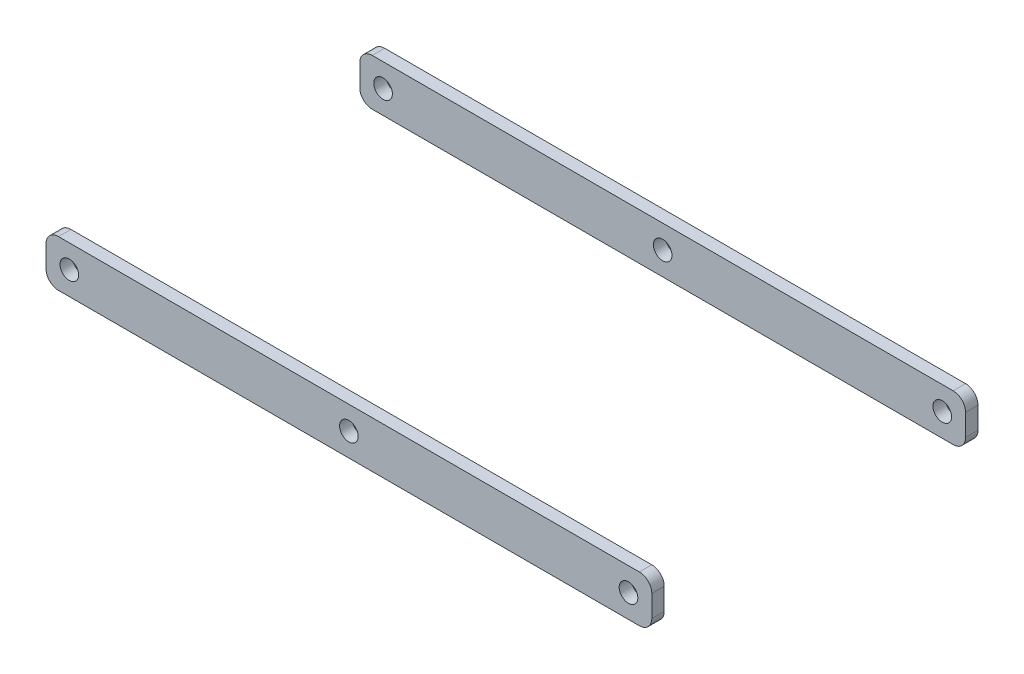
ISO-10303-21;
HEADER;
FILE_DESCRIPTION(('STEP AP214'),'2;1');
FILE_NAME('part.step','',(''),(''),'','','');
FILE_SCHEMA(('AUTOMOTIVE_DESIGN { 1 0 10303 214 1 1 1 1 }'));
ENDSEC;
DATA;
#1=APPLICATION_CONTEXT('core data for automotive mechanical design processes');
#2=APPLICATION_PROTOCOL_DEFINITION('international standard','automotive_design',2000,#1);
#3=PRODUCT_CONTEXT('',#1,'mechanical');
#4=PRODUCT('Part','Part','',(#3));
#5=PRODUCT_RELATED_PRODUCT_CATEGORY('part','',(#4));
#6=PRODUCT_DEFINITION_FORMATION('','',#4);
#7=PRODUCT_DEFINITION_CONTEXT('part definition',#1,'design');
#8=PRODUCT_DEFINITION('design','',#6,#7);
#9=PRODUCT_DEFINITION_SHAPE('','',#8);
#10=(LENGTH_UNIT() NAMED_UNIT(*) SI_UNIT(.MILLI.,.METRE.));
#11=(NAMED_UNIT(*) PLANE_ANGLE_UNIT() SI_UNIT($,.RADIAN.));
#12=(NAMED_UNIT(*) SI_UNIT($,.STERADIAN.) SOLID_ANGLE_UNIT());
#13=UNCERTAINTY_MEASURE_WITH_UNIT(LENGTH_MEASURE(1.E-05),#10,'distance_accuracy_value','');
#14=(GEOMETRIC_REPRESENTATION_CONTEXT(3) GLOBAL_UNCERTAINTY_ASSIGNED_CONTEXT((#13)) GLOBAL_UNIT_ASSIGNED_CONTEXT((#10,
#11,#12)) REPRESENTATION_CONTEXT('',''));
#15=CARTESIAN_POINT('',(0.,0.,0.));
#16=DIRECTION('',(0.,0.,1.));
#17=DIRECTION('',(1.,0.,0.));
#18=AXIS2_PLACEMENT_3D('',#15,#16,#17);
#19=CARTESIAN_POINT('',(195.,-15.,-105.));
#20=DIRECTION('',(1.,0.,0.));
#21=DIRECTION('',(0.,0.,-1.));
#22=AXIS2_PLACEMENT_3D('',#19,#20,#21);
#23=PLANE('',#22);
#24=DIRECTION('',(0.,1.,0.));
#25=VECTOR('',#24,1.);
#26=CARTESIAN_POINT('',(195.,-15.,-105.));
#27=LINE('',#26,#25);
#28=CARTESIAN_POINT('',(195.,-7.,-105.));
#29=VERTEX_POINT('',#28);
#30=CARTESIAN_POINT('',(195.,7.,-105.));
#31=VERTEX_POINT('',#30);
#32=EDGE_CURVE('E175',#29,#31,#27,.T.);
#33=ORIENTED_EDGE('',*,*,#32,.T.);
#34=DIRECTION('',(0.,0.,1.));
#35=VECTOR('',#34,1.);
#36=CARTESIAN_POINT('',(195.,7.,-105.));
#37=LINE('',#36,#35);
#38=CARTESIAN_POINT('',(195.,7.,-97.));
#39=VERTEX_POINT('',#38);
#40=EDGE_CURVE('E136',#31,#39,#37,.T.);
#41=ORIENTED_EDGE('',*,*,#40,.T.);
#42=DIRECTION('',(0.,1.,0.));
#43=VECTOR('',#42,1.);
#44=CARTESIAN_POINT('',(195.,-15.,-97.));
#45=LINE('',#44,#43);
#46=CARTESIAN_POINT('',(195.,-7.,-97.));
#47=VERTEX_POINT('',#46);
#48=EDGE_CURVE('E120',#47,#39,#45,.T.);
#49=ORIENTED_EDGE('',*,*,#48,.F.);
#50=DIRECTION('',(0.,0.,1.));
#51=VECTOR('',#50,1.);
#52=CARTESIAN_POINT('',(195.,-7.,-105.));
#53=LINE('',#52,#51);
#54=EDGE_CURVE('E133',#47,#29,#53,.F.);
#55=ORIENTED_EDGE('',*,*,#54,.T.);
#56=EDGE_LOOP('',(#33,#41,#49,#55));
#57=FACE_BOUND('',#56,.T.);
#58=ADVANCED_FACE('F51',(#57),#23,.T.);
#59=CARTESIAN_POINT('',(-195.,-15.,-105.));
#60=DIRECTION('',(0.,-1.,0.));
#61=DIRECTION('',(0.,0.,-1.));
#62=AXIS2_PLACEMENT_3D('',#59,#60,#61);
#63=PLANE('',#62);
#64=DIRECTION('',(1.,0.,0.));
#65=VECTOR('',#64,1.);
#66=CARTESIAN_POINT('',(-195.,-15.,-105.));
#67=LINE('',#66,#65);
#68=CARTESIAN_POINT('',(-187.,-15.,-105.));
#69=VERTEX_POINT('',#68);
#70=CARTESIAN_POINT('',(187.,-15.,-105.));
#71=VERTEX_POINT('',#70);
#72=EDGE_CURVE('E173',#69,#71,#67,.T.);
#73=ORIENTED_EDGE('',*,*,#72,.T.);
#74=DIRECTION('',(0.,0.,1.));
#75=VECTOR('',#74,1.);
#76=CARTESIAN_POINT('',(187.,-15.,-105.));
#77=LINE('',#76,#75);
#78=CARTESIAN_POINT('',(187.,-15.,-97.));
#79=VERTEX_POINT('',#78);
#80=EDGE_CURVE('E168',#71,#79,#77,.T.);
#81=ORIENTED_EDGE('',*,*,#80,.T.);
#82=DIRECTION('',(1.,0.,0.));
#83=VECTOR('',#82,1.);
#84=CARTESIAN_POINT('',(-195.,-15.,-97.));
#85=LINE('',#84,#83);
#86=CARTESIAN_POINT('',(-187.,-15.,-97.));
#87=VERTEX_POINT('',#86);
#88=EDGE_CURVE('E122',#87,#79,#85,.T.);
#89=ORIENTED_EDGE('',*,*,#88,.F.);
#90=DIRECTION('',(0.,0.,1.));
#91=VECTOR('',#90,1.);
#92=CARTESIAN_POINT('',(-187.,-15.,-105.));
#93=LINE('',#92,#91);
#94=EDGE_CURVE('E166',#87,#69,#93,.F.);
#95=ORIENTED_EDGE('',*,*,#94,.T.);
#96=EDGE_LOOP('',(#73,#81,#89,#95));
#97=FACE_BOUND('',#96,.T.);
#98=ADVANCED_FACE('F171',(#97),#63,.T.);
#99=CARTESIAN_POINT('',(-195.,-15.,-105.));
#100=DIRECTION('',(-1.,0.,0.));
#101=DIRECTION('',(0.,0.,1.));
#102=AXIS2_PLACEMENT_3D('',#99,#100,#101);
#103=PLANE('',#102);
#104=DIRECTION('',(0.,-1.,0.));
#105=VECTOR('',#104,1.);
#106=CARTESIAN_POINT('',(-195.,-15.,-105.));
#107=LINE('',#106,#105);
#108=CARTESIAN_POINT('',(-195.,7.,-105.));
#109=VERTEX_POINT('',#108);
#110=CARTESIAN_POINT('',(-195.,-7.,-105.));
#111=VERTEX_POINT('',#110);
#112=EDGE_CURVE('E174',#109,#111,#107,.T.);
#113=ORIENTED_EDGE('',*,*,#112,.T.);
#114=DIRECTION('',(0.,0.,1.));
#115=VECTOR('',#114,1.);
#116=CARTESIAN_POINT('',(-195.,-7.,-105.));
#117=LINE('',#116,#115);
#118=CARTESIAN_POINT('',(-195.,-7.,-97.));
#119=VERTEX_POINT('',#118);
#120=EDGE_CURVE('E12',#111,#119,#117,.T.);
#121=ORIENTED_EDGE('',*,*,#120,.T.);
#122=DIRECTION('',(0.,-1.,0.));
#123=VECTOR('',#122,1.);
#124=CARTESIAN_POINT('',(-195.,-15.,-97.));
#125=LINE('',#124,#123);
#126=CARTESIAN_POINT('',(-195.,7.,-97.));
#127=VERTEX_POINT('',#126);
#128=EDGE_CURVE('E146',#127,#119,#125,.T.);
#129=ORIENTED_EDGE('',*,*,#128,.F.);
#130=DIRECTION('',(0.,0.,1.));
#131=VECTOR('',#130,1.);
#132=CARTESIAN_POINT('',(-195.,7.,-105.));
#133=LINE('',#132,#131);
#134=EDGE_CURVE('E59',#127,#109,#133,.F.);
#135=ORIENTED_EDGE('',*,*,#134,.T.);
#136=EDGE_LOOP('',(#113,#121,#129,#135));
#137=FACE_BOUND('',#136,.T.);
#138=ADVANCED_FACE('F227',(#137),#103,.T.);
#139=CARTESIAN_POINT('',(-195.,15.,-105.));
#140=DIRECTION('',(0.,1.,0.));
#141=DIRECTION('',(0.,0.,1.));
#142=AXIS2_PLACEMENT_3D('',#139,#140,#141);
#143=PLANE('',#142);
#144=DIRECTION('',(-1.,0.,0.));
#145=VECTOR('',#144,1.);
#146=CARTESIAN_POINT('',(-195.,15.,-97.));
#147=LINE('',#146,#145);
#148=CARTESIAN_POINT('',(187.,15.,-97.));
#149=VERTEX_POINT('',#148);
#150=CARTESIAN_POINT('',(-187.,15.,-97.));
#151=VERTEX_POINT('',#150);
#152=EDGE_CURVE('E137',#149,#151,#147,.T.);
#153=ORIENTED_EDGE('',*,*,#152,.F.);
#154=DIRECTION('',(0.,0.,1.));
#155=VECTOR('',#154,1.);
#156=CARTESIAN_POINT('',(187.,15.,-105.));
#157=LINE('',#156,#155);
#158=CARTESIAN_POINT('',(187.,15.,-105.));
#159=VERTEX_POINT('',#158);
#160=EDGE_CURVE('E158',#149,#159,#157,.F.);
#161=ORIENTED_EDGE('',*,*,#160,.T.);
#162=DIRECTION('',(-1.,0.,0.));
#163=VECTOR('',#162,1.);
#164=CARTESIAN_POINT('',(-195.,15.,-105.));
#165=LINE('',#164,#163);
#166=CARTESIAN_POINT('',(-187.,15.,-105.));
#167=VERTEX_POINT('',#166);
#168=EDGE_CURVE('E138',#159,#167,#165,.T.);
#169=ORIENTED_EDGE('',*,*,#168,.T.);
#170=DIRECTION('',(0.,0.,1.));
#171=VECTOR('',#170,1.);
#172=CARTESIAN_POINT('',(-187.,15.,-105.));
#173=LINE('',#172,#171);
#174=EDGE_CURVE('E155',#167,#151,#173,.T.);
#175=ORIENTED_EDGE('',*,*,#174,.T.);
#176=EDGE_LOOP('',(#153,#161,#169,#175));
#177=FACE_BOUND('',#176,.T.);
#178=ADVANCED_FACE('F245',(#177),#143,.T.);
#179=CARTESIAN_POINT('',(0.,0.,-105.));
#180=DIRECTION('',(0.,0.,-1.));
#181=DIRECTION('',(-1.,0.,0.));
#182=AXIS2_PLACEMENT_3D('',#179,#180,#181);
#183=PLANE('',#182);
#184=CARTESIAN_POINT('',(-180.,0.,-105.));
#185=DIRECTION('',(0.,0.,-1.));
#186=DIRECTION('',(-1.,0.,0.));
#187=AXIS2_PLACEMENT_3D('',#184,#185,#186);
#188=CIRCLE('',#187,6.00000000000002);
#189=CARTESIAN_POINT('',(-186.,0.,-105.));
#190=VERTEX_POINT('',#189);
#191=EDGE_CURVE('E178',#190,#190,#188,.T.);
#192=ORIENTED_EDGE('',*,*,#191,.F.);
#193=EDGE_LOOP('',(#192));
#194=FACE_BOUND('',#193,.T.);
#195=CARTESIAN_POINT('',(0.,0.,-105.));
#196=DIRECTION('',(0.,0.,-1.));
#197=DIRECTION('',(-1.,0.,0.));
#198=AXIS2_PLACEMENT_3D('',#195,#196,#197);
#199=CIRCLE('',#198,6.);
#200=CARTESIAN_POINT('',(-6.,0.,-105.));
#201=VERTEX_POINT('',#200);
#202=EDGE_CURVE('E192',#201,#201,#199,.T.);
#203=ORIENTED_EDGE('',*,*,#202,.F.);
#204=EDGE_LOOP('',(#203));
#205=FACE_BOUND('',#204,.T.);
#206=CARTESIAN_POINT('',(180.,0.,-105.));
#207=DIRECTION('',(0.,0.,-1.));
#208=DIRECTION('',(-1.,0.,0.));
#209=AXIS2_PLACEMENT_3D('',#206,#207,#208);
#210=CIRCLE('',#209,6.00000000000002);
#211=CARTESIAN_POINT('',(174.,0.,-105.));
#212=VERTEX_POINT('',#211);
#213=EDGE_CURVE('E189',#212,#212,#210,.T.);
#214=ORIENTED_EDGE('',*,*,#213,.F.);
#215=EDGE_LOOP('',(#214));
#216=FACE_BOUND('',#215,.T.);
#217=ORIENTED_EDGE('',*,*,#168,.F.);
#218=CARTESIAN_POINT('',(187.,7.,-105.));
#219=DIRECTION('',(0.,0.,-1.));
#220=DIRECTION('',(-1.,0.,0.));
#221=AXIS2_PLACEMENT_3D('',#218,#219,#220);
#222=CIRCLE('',#221,8.);
#223=EDGE_CURVE('E164',#159,#31,#222,.T.);
#224=ORIENTED_EDGE('',*,*,#223,.T.);
#225=ORIENTED_EDGE('',*,*,#32,.F.);
#226=CARTESIAN_POINT('',(187.,-7.,-105.));
#227=DIRECTION('',(0.,0.,-1.));
#228=DIRECTION('',(-1.,0.,0.));
#229=AXIS2_PLACEMENT_3D('',#226,#227,#228);
#230=CIRCLE('',#229,8.);
#231=EDGE_CURVE('E142',#29,#71,#230,.T.);
#232=ORIENTED_EDGE('',*,*,#231,.T.);
#233=ORIENTED_EDGE('',*,*,#72,.F.);
#234=CARTESIAN_POINT('',(-187.,-7.,-105.));
#235=DIRECTION('',(0.,0.,-1.));
#236=DIRECTION('',(-1.,0.,0.));
#237=AXIS2_PLACEMENT_3D('',#234,#235,#236);
#238=CIRCLE('',#237,8.);
#239=EDGE_CURVE('E66',#69,#111,#238,.T.);
#240=ORIENTED_EDGE('',*,*,#239,.T.);
#241=ORIENTED_EDGE('',*,*,#112,.F.);
#242=CARTESIAN_POINT('',(-187.,7.,-105.));
#243=DIRECTION('',(0.,0.,-1.));
#244=DIRECTION('',(-1.,0.,0.));
#245=AXIS2_PLACEMENT_3D('',#242,#243,#244);
#246=CIRCLE('',#245,8.);
#247=EDGE_CURVE('E160',#109,#167,#246,.T.);
#248=ORIENTED_EDGE('',*,*,#247,.T.);
#249=EDGE_LOOP('',(#217,#224,#225,#232,#233,#240,#241,#248));
#250=FACE_BOUND('',#249,.T.);
#251=ADVANCED_FACE('F249',(#194,#205,#216,#250),#183,.T.);
#252=CARTESIAN_POINT('',(0.,0.,-97.));
#253=DIRECTION('',(0.,0.,-1.));
#254=DIRECTION('',(-1.,0.,0.));
#255=AXIS2_PLACEMENT_3D('',#252,#253,#254);
#256=PLANE('',#255);
#257=CARTESIAN_POINT('',(-180.,0.,-97.));
#258=DIRECTION('',(0.,0.,-1.));
#259=DIRECTION('',(-1.,0.,0.));
#260=AXIS2_PLACEMENT_3D('',#257,#258,#259);
#261=CIRCLE('',#260,6.00000000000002);
#262=CARTESIAN_POINT('',(-186.,0.,-97.));
#263=VERTEX_POINT('',#262);
#264=EDGE_CURVE('E149',#263,#263,#261,.T.);
#265=ORIENTED_EDGE('',*,*,#264,.T.);
#266=EDGE_LOOP('',(#265));
#267=FACE_BOUND('',#266,.T.);
#268=CARTESIAN_POINT('',(0.,0.,-97.));
#269=DIRECTION('',(0.,0.,-1.));
#270=DIRECTION('',(-1.,0.,0.));
#271=AXIS2_PLACEMENT_3D('',#268,#269,#270);
#272=CIRCLE('',#271,6.);
#273=CARTESIAN_POINT('',(-6.,0.,-97.));
#274=VERTEX_POINT('',#273);
#275=EDGE_CURVE('E190',#274,#274,#272,.T.);
#276=ORIENTED_EDGE('',*,*,#275,.T.);
#277=EDGE_LOOP('',(#276));
#278=FACE_BOUND('',#277,.T.);
#279=CARTESIAN_POINT('',(180.,0.,-97.));
#280=DIRECTION('',(0.,0.,-1.));
#281=DIRECTION('',(-1.,0.,0.));
#282=AXIS2_PLACEMENT_3D('',#279,#280,#281);
#283=CIRCLE('',#282,6.00000000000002);
#284=CARTESIAN_POINT('',(174.,0.,-97.));
#285=VERTEX_POINT('',#284);
#286=EDGE_CURVE('E187',#285,#285,#283,.T.);
#287=ORIENTED_EDGE('',*,*,#286,.T.);
#288=EDGE_LOOP('',(#287));
#289=FACE_BOUND('',#288,.T.);
#290=ORIENTED_EDGE('',*,*,#48,.T.);
#291=CARTESIAN_POINT('',(187.,7.,-97.));
#292=DIRECTION('',(0.,0.,-1.));
#293=DIRECTION('',(-1.,0.,0.));
#294=AXIS2_PLACEMENT_3D('',#291,#292,#293);
#295=CIRCLE('',#294,8.);
#296=EDGE_CURVE('E127',#39,#149,#295,.F.);
#297=ORIENTED_EDGE('',*,*,#296,.T.);
#298=ORIENTED_EDGE('',*,*,#152,.T.);
#299=CARTESIAN_POINT('',(-187.,7.,-97.));
#300=DIRECTION('',(0.,0.,-1.));
#301=DIRECTION('',(-1.,0.,0.));
#302=AXIS2_PLACEMENT_3D('',#299,#300,#301);
#303=CIRCLE('',#302,8.);
#304=EDGE_CURVE('E144',#151,#127,#303,.F.);
#305=ORIENTED_EDGE('',*,*,#304,.T.);
#306=ORIENTED_EDGE('',*,*,#128,.T.);
#307=CARTESIAN_POINT('',(-187.,-7.,-97.));
#308=DIRECTION('',(0.,0.,-1.));
#309=DIRECTION('',(-1.,0.,0.));
#310=AXIS2_PLACEMENT_3D('',#307,#308,#309);
#311=CIRCLE('',#310,8.);
#312=EDGE_CURVE('E128',#119,#87,#311,.F.);
#313=ORIENTED_EDGE('',*,*,#312,.T.);
#314=ORIENTED_EDGE('',*,*,#88,.T.);
#315=CARTESIAN_POINT('',(187.,-7.,-97.));
#316=DIRECTION('',(0.,0.,-1.));
#317=DIRECTION('',(-1.,0.,0.));
#318=AXIS2_PLACEMENT_3D('',#315,#316,#317);
#319=CIRCLE('',#318,8.);
#320=EDGE_CURVE('E117',#79,#47,#319,.F.);
#321=ORIENTED_EDGE('',*,*,#320,.T.);
#322=EDGE_LOOP('',(#290,#297,#298,#305,#306,#313,#314,#321));
#323=FACE_BOUND('',#322,.T.);
#324=ADVANCED_FACE('F119',(#267,#278,#289,#323),#256,.F.);
#325=CARTESIAN_POINT('',(180.,0.,-500.));
#326=DIRECTION('',(0.,0.,1.));
#327=DIRECTION('',(1.,0.,0.));
#328=AXIS2_PLACEMENT_3D('',#325,#326,#327);
#329=CYLINDRICAL_SURFACE('',#328,6.00000000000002);
#330=ORIENTED_EDGE('',*,*,#213,.T.);
#331=EDGE_LOOP('',(#330));
#332=FACE_BOUND('',#331,.T.);
#333=ORIENTED_EDGE('',*,*,#286,.F.);
#334=EDGE_LOOP('',(#333));
#335=FACE_BOUND('',#334,.T.);
#336=ADVANCED_FACE('F220',(#332,#335),#329,.F.);
#337=CARTESIAN_POINT('',(0.,0.,-500.));
#338=DIRECTION('',(0.,0.,1.));
#339=DIRECTION('',(1.,0.,0.));
#340=AXIS2_PLACEMENT_3D('',#337,#338,#339);
#341=CYLINDRICAL_SURFACE('',#340,6.);
#342=ORIENTED_EDGE('',*,*,#202,.T.);
#343=EDGE_LOOP('',(#342));
#344=FACE_BOUND('',#343,.T.);
#345=ORIENTED_EDGE('',*,*,#275,.F.);
#346=EDGE_LOOP('',(#345));
#347=FACE_BOUND('',#346,.T.);
#348=ADVANCED_FACE('F211',(#344,#347),#341,.F.);
#349=CARTESIAN_POINT('',(-180.,0.,-500.));
#350=DIRECTION('',(0.,0.,1.));
#351=DIRECTION('',(1.,0.,0.));
#352=AXIS2_PLACEMENT_3D('',#349,#350,#351);
#353=CYLINDRICAL_SURFACE('',#352,6.00000000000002);
#354=ORIENTED_EDGE('',*,*,#191,.T.);
#355=EDGE_LOOP('',(#354));
#356=FACE_BOUND('',#355,.T.);
#357=ORIENTED_EDGE('',*,*,#264,.F.);
#358=EDGE_LOOP('',(#357));
#359=FACE_BOUND('',#358,.T.);
#360=ADVANCED_FACE('F208',(#356,#359),#353,.F.);
#361=CARTESIAN_POINT('',(187.,7.,-105.));
#362=DIRECTION('',(0.,0.,1.));
#363=DIRECTION('',(1.,0.,0.));
#364=AXIS2_PLACEMENT_3D('',#361,#362,#363);
#365=CYLINDRICAL_SURFACE('',#364,8.);
#366=ORIENTED_EDGE('',*,*,#223,.F.);
#367=ORIENTED_EDGE('',*,*,#160,.F.);
#368=ORIENTED_EDGE('',*,*,#296,.F.);
#369=ORIENTED_EDGE('',*,*,#40,.F.);
#370=EDGE_LOOP('',(#366,#367,#368,#369));
#371=FACE_BOUND('',#370,.T.);
#372=ADVANCED_FACE('F210',(#371),#365,.T.);
#373=CARTESIAN_POINT('',(187.,-7.,-105.));
#374=DIRECTION('',(0.,0.,1.));
#375=DIRECTION('',(1.,0.,0.));
#376=AXIS2_PLACEMENT_3D('',#373,#374,#375);
#377=CYLINDRICAL_SURFACE('',#376,8.);
#378=ORIENTED_EDGE('',*,*,#231,.F.);
#379=ORIENTED_EDGE('',*,*,#54,.F.);
#380=ORIENTED_EDGE('',*,*,#320,.F.);
#381=ORIENTED_EDGE('',*,*,#80,.F.);
#382=EDGE_LOOP('',(#378,#379,#380,#381));
#383=FACE_BOUND('',#382,.T.);
#384=ADVANCED_FACE('F141',(#383),#377,.T.);
#385=CARTESIAN_POINT('',(-187.,-7.,-105.));
#386=DIRECTION('',(0.,0.,1.));
#387=DIRECTION('',(1.,0.,0.));
#388=AXIS2_PLACEMENT_3D('',#385,#386,#387);
#389=CYLINDRICAL_SURFACE('',#388,8.);
#390=ORIENTED_EDGE('',*,*,#239,.F.);
#391=ORIENTED_EDGE('',*,*,#94,.F.);
#392=ORIENTED_EDGE('',*,*,#312,.F.);
#393=ORIENTED_EDGE('',*,*,#120,.F.);
#394=EDGE_LOOP('',(#390,#391,#392,#393));
#395=FACE_BOUND('',#394,.T.);
#396=ADVANCED_FACE('F232',(#395),#389,.T.);
#397=CARTESIAN_POINT('',(-187.,7.,-105.));
#398=DIRECTION('',(0.,0.,1.));
#399=DIRECTION('',(1.,0.,0.));
#400=AXIS2_PLACEMENT_3D('',#397,#398,#399);
#401=CYLINDRICAL_SURFACE('',#400,8.);
#402=ORIENTED_EDGE('',*,*,#247,.F.);
#403=ORIENTED_EDGE('',*,*,#134,.F.);
#404=ORIENTED_EDGE('',*,*,#304,.F.);
#405=ORIENTED_EDGE('',*,*,#174,.F.);
#406=EDGE_LOOP('',(#402,#403,#404,#405));
#407=FACE_BOUND('',#406,.T.);
#408=ADVANCED_FACE('F53',(#407),#401,.T.);
#409=CLOSED_SHELL('',(#58,#98,#138,#178,#251,#324,#336,#348,#360,#372,#384,#396,#408));
#410=MANIFOLD_SOLID_BREP('B2',#409);
#411=CARTESIAN_POINT('',(0.,0.,105.));
#412=DIRECTION('',(0.,0.,-1.));
#413=DIRECTION('',(-1.,0.,0.));
#414=AXIS2_PLACEMENT_3D('',#411,#412,#413);
#415=PLANE('',#414);
#416=CARTESIAN_POINT('',(-180.,0.,105.));
#417=DIRECTION('',(0.,0.,-1.));
#418=DIRECTION('',(-1.,0.,0.));
#419=AXIS2_PLACEMENT_3D('',#416,#417,#418);
#420=CIRCLE('',#419,6.00000000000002);
#421=CARTESIAN_POINT('',(-186.,0.,105.));
#422=VERTEX_POINT('',#421);
#423=EDGE_CURVE('E473',#422,#422,#420,.T.);
#424=ORIENTED_EDGE('',*,*,#423,.T.);
#425=EDGE_LOOP('',(#424));
#426=FACE_BOUND('',#425,.T.);
#427=CARTESIAN_POINT('',(0.,0.,105.));
#428=DIRECTION('',(0.,0.,-1.));
#429=DIRECTION('',(-1.,0.,0.));
#430=AXIS2_PLACEMENT_3D('',#427,#428,#429);
#431=CIRCLE('',#430,6.);
#432=CARTESIAN_POINT('',(-6.,0.,105.));
#433=VERTEX_POINT('',#432);
#434=EDGE_CURVE('E470',#433,#433,#431,.T.);
#435=ORIENTED_EDGE('',*,*,#434,.T.);
#436=EDGE_LOOP('',(#435));
#437=FACE_BOUND('',#436,.T.);
#438=CARTESIAN_POINT('',(180.,0.,105.));
#439=DIRECTION('',(0.,0.,-1.));
#440=DIRECTION('',(-1.,0.,0.));
#441=AXIS2_PLACEMENT_3D('',#438,#439,#440);
#442=CIRCLE('',#441,6.00000000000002);
#443=CARTESIAN_POINT('',(174.,0.,105.));
#444=VERTEX_POINT('',#443);
#445=EDGE_CURVE('E466',#444,#444,#442,.T.);
#446=ORIENTED_EDGE('',*,*,#445,.T.);
#447=EDGE_LOOP('',(#446));
#448=FACE_BOUND('',#447,.T.);
#449=DIRECTION('',(0.,1.,0.));
#450=VECTOR('',#449,1.);
#451=CARTESIAN_POINT('',(195.,-15.,105.));
#452=LINE('',#451,#450);
#453=CARTESIAN_POINT('',(195.,-7.,105.));
#454=VERTEX_POINT('',#453);
#455=CARTESIAN_POINT('',(195.,7.,105.));
#456=VERTEX_POINT('',#455);
#457=EDGE_CURVE('E416',#454,#456,#452,.T.);
#458=ORIENTED_EDGE('',*,*,#457,.T.);
#459=CARTESIAN_POINT('',(187.,7.,105.));
#460=DIRECTION('',(0.,0.,-1.));
#461=DIRECTION('',(-1.,0.,0.));
#462=AXIS2_PLACEMENT_3D('',#459,#460,#461);
#463=CIRCLE('',#462,8.);
#464=CARTESIAN_POINT('',(187.,15.,105.));
#465=VERTEX_POINT('',#464);
#466=EDGE_CURVE('E480',#456,#465,#463,.F.);
#467=ORIENTED_EDGE('',*,*,#466,.T.);
#468=DIRECTION('',(-1.,0.,0.));
#469=VECTOR('',#468,1.);
#470=CARTESIAN_POINT('',(-195.,15.,105.));
#471=LINE('',#470,#469);
#472=CARTESIAN_POINT('',(-187.,15.,105.));
#473=VERTEX_POINT('',#472);
#474=EDGE_CURVE('E459',#465,#473,#471,.T.);
#475=ORIENTED_EDGE('',*,*,#474,.T.);
#476=CARTESIAN_POINT('',(-187.,7.,105.));
#477=DIRECTION('',(0.,0.,-1.));
#478=DIRECTION('',(-1.,0.,0.));
#479=AXIS2_PLACEMENT_3D('',#476,#477,#478);
#480=CIRCLE('',#479,8.);
#481=CARTESIAN_POINT('',(-195.,7.,105.));
#482=VERTEX_POINT('',#481);
#483=EDGE_CURVE('E478',#473,#482,#480,.F.);
#484=ORIENTED_EDGE('',*,*,#483,.T.);
#485=DIRECTION('',(0.,-1.,0.));
#486=VECTOR('',#485,1.);
#487=CARTESIAN_POINT('',(-195.,-15.,105.));
#488=LINE('',#487,#486);
#489=CARTESIAN_POINT('',(-195.,-7.,105.));
#490=VERTEX_POINT('',#489);
#491=EDGE_CURVE('E455',#482,#490,#488,.T.);
#492=ORIENTED_EDGE('',*,*,#491,.T.);
#493=CARTESIAN_POINT('',(-187.,-7.,105.));
#494=DIRECTION('',(0.,0.,-1.));
#495=DIRECTION('',(-1.,0.,0.));
#496=AXIS2_PLACEMENT_3D('',#493,#494,#495);
#497=CIRCLE('',#496,8.);
#498=CARTESIAN_POINT('',(-187.,-15.,105.));
#499=VERTEX_POINT('',#498);
#500=EDGE_CURVE('E454',#490,#499,#497,.F.);
#501=ORIENTED_EDGE('',*,*,#500,.T.);
#502=DIRECTION('',(1.,0.,0.));
#503=VECTOR('',#502,1.);
#504=CARTESIAN_POINT('',(-195.,-15.,105.));
#505=LINE('',#504,#503);
#506=CARTESIAN_POINT('',(187.,-15.,105.));
#507=VERTEX_POINT('',#506);
#508=EDGE_CURVE('E449',#499,#507,#505,.T.);
#509=ORIENTED_EDGE('',*,*,#508,.T.);
#510=CARTESIAN_POINT('',(187.,-7.,105.));
#511=DIRECTION('',(0.,0.,-1.));
#512=DIRECTION('',(-1.,0.,0.));
#513=AXIS2_PLACEMENT_3D('',#510,#511,#512);
#514=CIRCLE('',#513,8.);
#515=EDGE_CURVE('E452',#507,#454,#514,.F.);
#516=ORIENTED_EDGE('',*,*,#515,.T.);
#517=EDGE_LOOP('',(#458,#467,#475,#484,#492,#501,#509,#516));
#518=FACE_BOUND('',#517,.T.);
#519=ADVANCED_FACE('F342',(#426,#437,#448,#518),#415,.F.);
#520=CARTESIAN_POINT('',(-195.,15.,-105.));
#521=DIRECTION('',(0.,1.,0.));
#522=DIRECTION('',(0.,0.,1.));
#523=AXIS2_PLACEMENT_3D('',#520,#521,#522);
#524=PLANE('',#523);
#525=ORIENTED_EDGE('',*,*,#474,.F.);
#526=DIRECTION('',(0.,0.,1.));
#527=VECTOR('',#526,1.);
#528=CARTESIAN_POINT('',(187.,15.,-105.));
#529=LINE('',#528,#527);
#530=CARTESIAN_POINT('',(187.,15.,97.));
#531=VERTEX_POINT('',#530);
#532=EDGE_CURVE('E432',#465,#531,#529,.F.);
#533=ORIENTED_EDGE('',*,*,#532,.T.);
#534=DIRECTION('',(-1.,0.,0.));
#535=VECTOR('',#534,1.);
#536=CARTESIAN_POINT('',(-195.,15.,97.));
#537=LINE('',#536,#535);
#538=CARTESIAN_POINT('',(-187.,15.,97.));
#539=VERTEX_POINT('',#538);
#540=EDGE_CURVE('E420',#531,#539,#537,.T.);
#541=ORIENTED_EDGE('',*,*,#540,.T.);
#542=DIRECTION('',(0.,0.,1.));
#543=VECTOR('',#542,1.);
#544=CARTESIAN_POINT('',(-187.,15.,-105.));
#545=LINE('',#544,#543);
#546=EDGE_CURVE('E436',#539,#473,#545,.T.);
#547=ORIENTED_EDGE('',*,*,#546,.T.);
#548=EDGE_LOOP('',(#525,#533,#541,#547));
#549=FACE_BOUND('',#548,.T.);
#550=ADVANCED_FACE('F486',(#549),#524,.T.);
#551=CARTESIAN_POINT('',(-195.,-15.,-105.));
#552=DIRECTION('',(-1.,0.,0.));
#553=DIRECTION('',(0.,0.,1.));
#554=AXIS2_PLACEMENT_3D('',#551,#552,#553);
#555=PLANE('',#554);
#556=ORIENTED_EDGE('',*,*,#491,.F.);
#557=DIRECTION('',(0.,0.,1.));
#558=VECTOR('',#557,1.);
#559=CARTESIAN_POINT('',(-195.,7.,-105.));
#560=LINE('',#559,#558);
#561=CARTESIAN_POINT('',(-195.,7.,97.));
#562=VERTEX_POINT('',#561);
#563=EDGE_CURVE('E364',#482,#562,#560,.F.);
#564=ORIENTED_EDGE('',*,*,#563,.T.);
#565=DIRECTION('',(0.,-1.,0.));
#566=VECTOR('',#565,1.);
#567=CARTESIAN_POINT('',(-195.,-15.,97.));
#568=LINE('',#567,#566);
#569=CARTESIAN_POINT('',(-195.,-7.,97.));
#570=VERTEX_POINT('',#569);
#571=EDGE_CURVE('E493',#562,#570,#568,.T.);
#572=ORIENTED_EDGE('',*,*,#571,.T.);
#573=DIRECTION('',(0.,0.,1.));
#574=VECTOR('',#573,1.);
#575=CARTESIAN_POINT('',(-195.,-7.,-105.));
#576=LINE('',#575,#574);
#577=EDGE_CURVE('E442',#570,#490,#576,.T.);
#578=ORIENTED_EDGE('',*,*,#577,.T.);
#579=EDGE_LOOP('',(#556,#564,#572,#578));
#580=FACE_BOUND('',#579,.T.);
#581=ADVANCED_FACE('F524',(#580),#555,.T.);
#582=CARTESIAN_POINT('',(-195.,-15.,-105.));
#583=DIRECTION('',(0.,-1.,0.));
#584=DIRECTION('',(0.,0.,-1.));
#585=AXIS2_PLACEMENT_3D('',#582,#583,#584);
#586=PLANE('',#585);
#587=ORIENTED_EDGE('',*,*,#508,.F.);
#588=DIRECTION('',(0.,0.,1.));
#589=VECTOR('',#588,1.);
#590=CARTESIAN_POINT('',(-187.,-15.,-105.));
#591=LINE('',#590,#589);
#592=CARTESIAN_POINT('',(-187.,-15.,97.));
#593=VERTEX_POINT('',#592);
#594=EDGE_CURVE('E49',#499,#593,#591,.F.);
#595=ORIENTED_EDGE('',*,*,#594,.T.);
#596=DIRECTION('',(1.,0.,0.));
#597=VECTOR('',#596,1.);
#598=CARTESIAN_POINT('',(-195.,-15.,97.));
#599=LINE('',#598,#597);
#600=CARTESIAN_POINT('',(187.,-15.,97.));
#601=VERTEX_POINT('',#600);
#602=EDGE_CURVE('E428',#593,#601,#599,.T.);
#603=ORIENTED_EDGE('',*,*,#602,.T.);
#604=DIRECTION('',(0.,0.,1.));
#605=VECTOR('',#604,1.);
#606=CARTESIAN_POINT('',(187.,-15.,-105.));
#607=LINE('',#606,#605);
#608=EDGE_CURVE('E350',#601,#507,#607,.T.);
#609=ORIENTED_EDGE('',*,*,#608,.T.);
#610=EDGE_LOOP('',(#587,#595,#603,#609));
#611=FACE_BOUND('',#610,.T.);
#612=ADVANCED_FACE('F448',(#611),#586,.T.);
#613=CARTESIAN_POINT('',(195.,-15.,-105.));
#614=DIRECTION('',(1.,0.,0.));
#615=DIRECTION('',(0.,0.,-1.));
#616=AXIS2_PLACEMENT_3D('',#613,#614,#615);
#617=PLANE('',#616);
#618=DIRECTION('',(0.,1.,0.));
#619=VECTOR('',#618,1.);
#620=CARTESIAN_POINT('',(195.,-15.,97.));
#621=LINE('',#620,#619);
#622=CARTESIAN_POINT('',(195.,-7.,97.));
#623=VERTEX_POINT('',#622);
#624=CARTESIAN_POINT('',(195.,7.,97.));
#625=VERTEX_POINT('',#624);
#626=EDGE_CURVE('E413',#623,#625,#621,.T.);
#627=ORIENTED_EDGE('',*,*,#626,.T.);
#628=DIRECTION('',(0.,0.,1.));
#629=VECTOR('',#628,1.);
#630=CARTESIAN_POINT('',(195.,7.,-105.));
#631=LINE('',#630,#629);
#632=EDGE_CURVE('E419',#625,#456,#631,.T.);
#633=ORIENTED_EDGE('',*,*,#632,.T.);
#634=ORIENTED_EDGE('',*,*,#457,.F.);
#635=DIRECTION('',(0.,0.,1.));
#636=VECTOR('',#635,1.);
#637=CARTESIAN_POINT('',(195.,-7.,-105.));
#638=LINE('',#637,#636);
#639=EDGE_CURVE('E409',#454,#623,#638,.F.);
#640=ORIENTED_EDGE('',*,*,#639,.T.);
#641=EDGE_LOOP('',(#627,#633,#634,#640));
#642=FACE_BOUND('',#641,.T.);
#643=ADVANCED_FACE('F411',(#642),#617,.T.);
#644=CARTESIAN_POINT('',(0.,0.,97.));
#645=DIRECTION('',(0.,0.,-1.));
#646=DIRECTION('',(-1.,0.,0.));
#647=AXIS2_PLACEMENT_3D('',#644,#645,#646);
#648=PLANE('',#647);
#649=CARTESIAN_POINT('',(-180.,0.,97.));
#650=DIRECTION('',(0.,0.,-1.));
#651=DIRECTION('',(-1.,0.,0.));
#652=AXIS2_PLACEMENT_3D('',#649,#650,#651);
#653=CIRCLE('',#652,6.00000000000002);
#654=CARTESIAN_POINT('',(-186.,0.,97.));
#655=VERTEX_POINT('',#654);
#656=EDGE_CURVE('E471',#655,#655,#653,.T.);
#657=ORIENTED_EDGE('',*,*,#656,.F.);
#658=EDGE_LOOP('',(#657));
#659=FACE_BOUND('',#658,.T.);
#660=CARTESIAN_POINT('',(0.,0.,97.));
#661=DIRECTION('',(0.,0.,-1.));
#662=DIRECTION('',(-1.,0.,0.));
#663=AXIS2_PLACEMENT_3D('',#660,#661,#662);
#664=CIRCLE('',#663,6.);
#665=CARTESIAN_POINT('',(-6.,0.,97.));
#666=VERTEX_POINT('',#665);
#667=EDGE_CURVE('E467',#666,#666,#664,.T.);
#668=ORIENTED_EDGE('',*,*,#667,.F.);
#669=EDGE_LOOP('',(#668));
#670=FACE_BOUND('',#669,.T.);
#671=CARTESIAN_POINT('',(180.,0.,97.));
#672=DIRECTION('',(0.,0.,-1.));
#673=DIRECTION('',(-1.,0.,0.));
#674=AXIS2_PLACEMENT_3D('',#671,#672,#673);
#675=CIRCLE('',#674,6.00000000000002);
#676=CARTESIAN_POINT('',(174.,0.,97.));
#677=VERTEX_POINT('',#676);
#678=EDGE_CURVE('E463',#677,#677,#675,.T.);
#679=ORIENTED_EDGE('',*,*,#678,.F.);
#680=EDGE_LOOP('',(#679));
#681=FACE_BOUND('',#680,.T.);
#682=ORIENTED_EDGE('',*,*,#540,.F.);
#683=CARTESIAN_POINT('',(187.,7.,97.));
#684=DIRECTION('',(0.,0.,-1.));
#685=DIRECTION('',(-1.,0.,0.));
#686=AXIS2_PLACEMENT_3D('',#683,#684,#685);
#687=CIRCLE('',#686,8.);
#688=EDGE_CURVE('E427',#531,#625,#687,.T.);
#689=ORIENTED_EDGE('',*,*,#688,.T.);
#690=ORIENTED_EDGE('',*,*,#626,.F.);
#691=CARTESIAN_POINT('',(187.,-7.,97.));
#692=DIRECTION('',(0.,0.,-1.));
#693=DIRECTION('',(-1.,0.,0.));
#694=AXIS2_PLACEMENT_3D('',#691,#692,#693);
#695=CIRCLE('',#694,8.);
#696=EDGE_CURVE('E424',#623,#601,#695,.T.);
#697=ORIENTED_EDGE('',*,*,#696,.T.);
#698=ORIENTED_EDGE('',*,*,#602,.F.);
#699=CARTESIAN_POINT('',(-187.,-7.,97.));
#700=DIRECTION('',(0.,0.,-1.));
#701=DIRECTION('',(-1.,0.,0.));
#702=AXIS2_PLACEMENT_3D('',#699,#700,#701);
#703=CIRCLE('',#702,8.);
#704=EDGE_CURVE('E357',#593,#570,#703,.T.);
#705=ORIENTED_EDGE('',*,*,#704,.T.);
#706=ORIENTED_EDGE('',*,*,#571,.F.);
#707=CARTESIAN_POINT('',(-187.,7.,97.));
#708=DIRECTION('',(0.,0.,-1.));
#709=DIRECTION('',(-1.,0.,0.));
#710=AXIS2_PLACEMENT_3D('',#707,#708,#709);
#711=CIRCLE('',#710,8.);
#712=EDGE_CURVE('E434',#562,#539,#711,.T.);
#713=ORIENTED_EDGE('',*,*,#712,.T.);
#714=EDGE_LOOP('',(#682,#689,#690,#697,#698,#705,#706,#713));
#715=FACE_BOUND('',#714,.T.);
#716=ADVANCED_FACE('F423',(#659,#670,#681,#715),#648,.T.);
#717=CARTESIAN_POINT('',(180.,0.,-500.));
#718=DIRECTION('',(0.,0.,1.));
#719=DIRECTION('',(1.,0.,0.));
#720=AXIS2_PLACEMENT_3D('',#717,#718,#719);
#721=CYLINDRICAL_SURFACE('',#720,6.00000000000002);
#722=ORIENTED_EDGE('',*,*,#678,.T.);
#723=EDGE_LOOP('',(#722));
#724=FACE_BOUND('',#723,.T.);
#725=ORIENTED_EDGE('',*,*,#445,.F.);
#726=EDGE_LOOP('',(#725));
#727=FACE_BOUND('',#726,.T.);
#728=ADVANCED_FACE('F503',(#724,#727),#721,.F.);
#729=CARTESIAN_POINT('',(0.,0.,-500.));
#730=DIRECTION('',(0.,0.,1.));
#731=DIRECTION('',(1.,0.,0.));
#732=AXIS2_PLACEMENT_3D('',#729,#730,#731);
#733=CYLINDRICAL_SURFACE('',#732,6.);
#734=ORIENTED_EDGE('',*,*,#667,.T.);
#735=EDGE_LOOP('',(#734));
#736=FACE_BOUND('',#735,.T.);
#737=ORIENTED_EDGE('',*,*,#434,.F.);
#738=EDGE_LOOP('',(#737));
#739=FACE_BOUND('',#738,.T.);
#740=ADVANCED_FACE('F505',(#736,#739),#733,.F.);
#741=CARTESIAN_POINT('',(-180.,0.,-500.));
#742=DIRECTION('',(0.,0.,1.));
#743=DIRECTION('',(1.,0.,0.));
#744=AXIS2_PLACEMENT_3D('',#741,#742,#743);
#745=CYLINDRICAL_SURFACE('',#744,6.00000000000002);
#746=ORIENTED_EDGE('',*,*,#656,.T.);
#747=EDGE_LOOP('',(#746));
#748=FACE_BOUND('',#747,.T.);
#749=ORIENTED_EDGE('',*,*,#423,.F.);
#750=EDGE_LOOP('',(#749));
#751=FACE_BOUND('',#750,.T.);
#752=ADVANCED_FACE('F511',(#748,#751),#745,.F.);
#753=CARTESIAN_POINT('',(187.,7.,-105.));
#754=DIRECTION('',(0.,0.,1.));
#755=DIRECTION('',(1.,0.,0.));
#756=AXIS2_PLACEMENT_3D('',#753,#754,#755);
#757=CYLINDRICAL_SURFACE('',#756,8.);
#758=ORIENTED_EDGE('',*,*,#688,.F.);
#759=ORIENTED_EDGE('',*,*,#532,.F.);
#760=ORIENTED_EDGE('',*,*,#466,.F.);
#761=ORIENTED_EDGE('',*,*,#632,.F.);
#762=EDGE_LOOP('',(#758,#759,#760,#761));
#763=FACE_BOUND('',#762,.T.);
#764=ADVANCED_FACE('F534',(#763),#757,.T.);
#765=CARTESIAN_POINT('',(-187.,7.,-105.));
#766=DIRECTION('',(0.,0.,1.));
#767=DIRECTION('',(1.,0.,0.));
#768=AXIS2_PLACEMENT_3D('',#765,#766,#767);
#769=CYLINDRICAL_SURFACE('',#768,8.);
#770=ORIENTED_EDGE('',*,*,#712,.F.);
#771=ORIENTED_EDGE('',*,*,#563,.F.);
#772=ORIENTED_EDGE('',*,*,#483,.F.);
#773=ORIENTED_EDGE('',*,*,#546,.F.);
#774=EDGE_LOOP('',(#770,#771,#772,#773));
#775=FACE_BOUND('',#774,.T.);
#776=ADVANCED_FACE('F537',(#775),#769,.T.);
#777=CARTESIAN_POINT('',(-187.,-7.,-105.));
#778=DIRECTION('',(0.,0.,1.));
#779=DIRECTION('',(1.,0.,0.));
#780=AXIS2_PLACEMENT_3D('',#777,#778,#779);
#781=CYLINDRICAL_SURFACE('',#780,8.);
#782=ORIENTED_EDGE('',*,*,#704,.F.);
#783=ORIENTED_EDGE('',*,*,#594,.F.);
#784=ORIENTED_EDGE('',*,*,#500,.F.);
#785=ORIENTED_EDGE('',*,*,#577,.F.);
#786=EDGE_LOOP('',(#782,#783,#784,#785));
#787=FACE_BOUND('',#786,.T.);
#788=ADVANCED_FACE('F540',(#787),#781,.T.);
#789=CARTESIAN_POINT('',(187.,-7.,-105.));
#790=DIRECTION('',(0.,0.,1.));
#791=DIRECTION('',(1.,0.,0.));
#792=AXIS2_PLACEMENT_3D('',#789,#790,#791);
#793=CYLINDRICAL_SURFACE('',#792,8.);
#794=ORIENTED_EDGE('',*,*,#696,.F.);
#795=ORIENTED_EDGE('',*,*,#639,.F.);
#796=ORIENTED_EDGE('',*,*,#515,.F.);
#797=ORIENTED_EDGE('',*,*,#608,.F.);
#798=EDGE_LOOP('',(#794,#795,#796,#797));
#799=FACE_BOUND('',#798,.T.);
#800=ADVANCED_FACE('F344',(#799),#793,.T.);
#801=CLOSED_SHELL('',(#519,#550,#581,#612,#643,#716,#728,#740,#752,#764,#776,#788,#800));
#802=MANIFOLD_SOLID_BREP('B6',#801);
#803=ADVANCED_BREP_SHAPE_REPRESENTATION('',(#18,#410,#802),#14);
#804=SHAPE_DEFINITION_REPRESENTATION(#9,#803);
ENDSEC;
END-ISO-10303-21;
